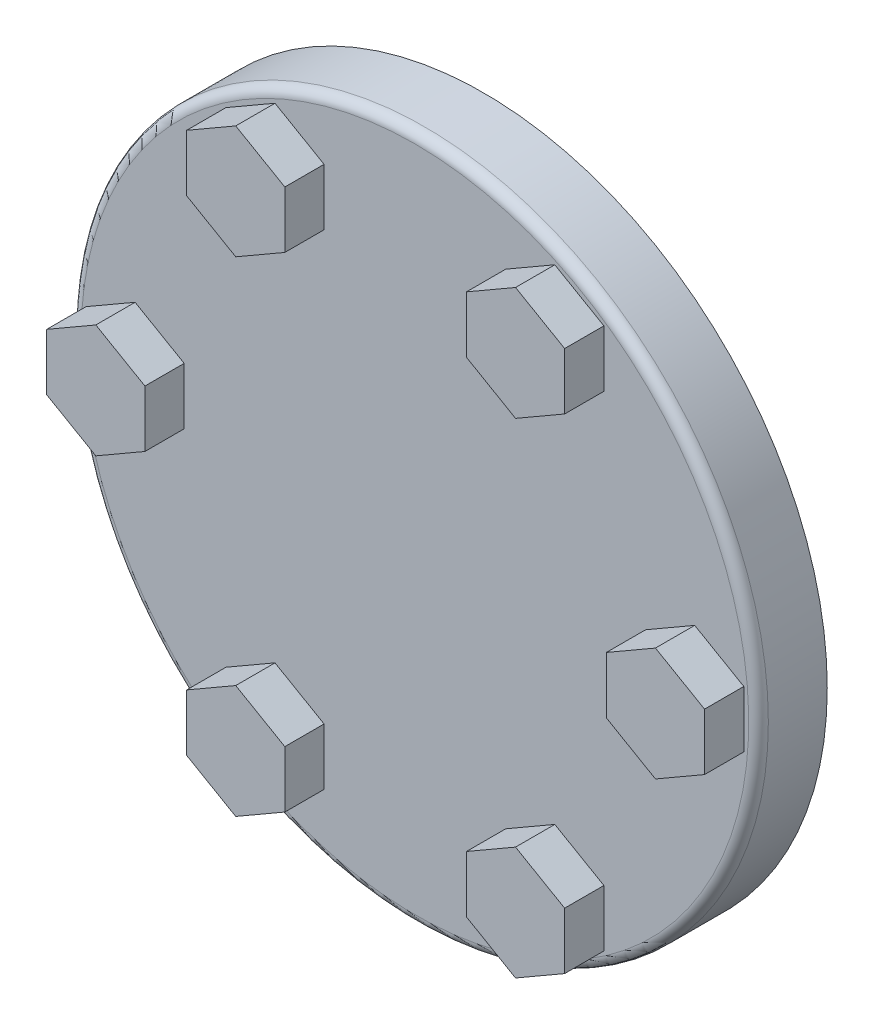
ISO-10303-21;
HEADER;
FILE_DESCRIPTION(('STEP AP214'),'2;1');
FILE_NAME('part.step','',(''),(''),'','','');
FILE_SCHEMA(('AUTOMOTIVE_DESIGN { 1 0 10303 214 1 1 1 1 }'));
ENDSEC;
DATA;
#1=APPLICATION_CONTEXT('core data for automotive mechanical design processes');
#2=APPLICATION_PROTOCOL_DEFINITION('international standard','automotive_design',2000,#1);
#3=PRODUCT_CONTEXT('',#1,'mechanical');
#4=PRODUCT('Part','Part','',(#3));
#5=PRODUCT_RELATED_PRODUCT_CATEGORY('part','',(#4));
#6=PRODUCT_DEFINITION_FORMATION('','',#4);
#7=PRODUCT_DEFINITION_CONTEXT('part definition',#1,'design');
#8=PRODUCT_DEFINITION('design','',#6,#7);
#9=PRODUCT_DEFINITION_SHAPE('','',#8);
#10=(LENGTH_UNIT() NAMED_UNIT(*) SI_UNIT(.MILLI.,.METRE.));
#11=(NAMED_UNIT(*) PLANE_ANGLE_UNIT() SI_UNIT($,.RADIAN.));
#12=(NAMED_UNIT(*) SI_UNIT($,.STERADIAN.) SOLID_ANGLE_UNIT());
#13=UNCERTAINTY_MEASURE_WITH_UNIT(LENGTH_MEASURE(1.E-05),#10,'distance_accuracy_value','');
#14=(GEOMETRIC_REPRESENTATION_CONTEXT(3) GLOBAL_UNCERTAINTY_ASSIGNED_CONTEXT((#13)) GLOBAL_UNIT_ASSIGNED_CONTEXT((#10,
#11,#12)) REPRESENTATION_CONTEXT('',''));
#15=CARTESIAN_POINT('',(0.,0.,0.));
#16=DIRECTION('',(0.,0.,1.));
#17=DIRECTION('',(1.,0.,0.));
#18=AXIS2_PLACEMENT_3D('',#15,#16,#17);
#19=CARTESIAN_POINT('',(16.7499999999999,17.464845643,178.5));
#20=DIRECTION('',(0.,0.,-1.));
#21=DIRECTION('',(-1.,0.,0.));
#22=AXIS2_PLACEMENT_3D('',#19,#20,#21);
#23=PLANE('',#22);
#24=DIRECTION('',(0.,1.,0.));
#25=VECTOR('',#24,1.);
#26=CARTESIAN_POINT('',(9.24999999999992,21.794972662,178.5));
#27=LINE('',#26,#25);
#28=CARTESIAN_POINT('',(9.24999999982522,27.5684753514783,178.5));
#29=VERTEX_POINT('',#28);
#30=CARTESIAN_POINT('',(9.25000000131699,21.7949726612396,178.5));
#31=VERTEX_POINT('',#30);
#32=EDGE_CURVE('E267',#29,#31,#27,.F.);
#33=ORIENTED_EDGE('',*,*,#32,.T.);
#34=DIRECTION('',(-0.866025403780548,0.500000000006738,0.));
#35=VECTOR('',#34,1.);
#36=CARTESIAN_POINT('',(14.2499999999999,18.908221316,178.5));
#37=LINE('',#36,#35);
#38=CARTESIAN_POINT('',(14.2499999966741,18.9082213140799,178.5));
#39=VERTEX_POINT('',#38);
#40=EDGE_CURVE('E257',#31,#39,#37,.F.);
#41=ORIENTED_EDGE('',*,*,#40,.T.);
#42=DIRECTION('',(-0.866025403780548,-0.500000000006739,0.));
#43=VECTOR('',#42,1.);
#44=CARTESIAN_POINT('',(19.2499999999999,21.794972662,178.5));
#45=LINE('',#44,#43);
#46=CARTESIAN_POINT('',(19.2500000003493,21.7949726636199,178.5));
#47=VERTEX_POINT('',#46);
#48=EDGE_CURVE('E310',#39,#47,#45,.F.);
#49=ORIENTED_EDGE('',*,*,#48,.T.);
#50=DIRECTION('',(0.,1.,0.));
#51=VECTOR('',#50,1.);
#52=CARTESIAN_POINT('',(19.2499999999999,27.568475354,178.5));
#53=LINE('',#52,#51);
#54=CARTESIAN_POINT('',(19.2500000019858,27.5684753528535,178.5));
#55=VERTEX_POINT('',#54);
#56=EDGE_CURVE('E295',#47,#55,#53,.T.);
#57=ORIENTED_EDGE('',*,*,#56,.T.);
#58=DIRECTION('',(0.866025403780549,-0.500000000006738,0.));
#59=VECTOR('',#58,1.);
#60=CARTESIAN_POINT('',(14.2499999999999,30.4552267,178.5));
#61=LINE('',#60,#59);
#62=CARTESIAN_POINT('',(14.249999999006,30.4552266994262,178.5));
#63=VERTEX_POINT('',#62);
#64=EDGE_CURVE('E288',#55,#63,#61,.F.);
#65=ORIENTED_EDGE('',*,*,#64,.T.);
#66=DIRECTION('',(0.866025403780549,0.500000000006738,0.));
#67=VECTOR('',#66,1.);
#68=CARTESIAN_POINT('',(9.24999999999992,27.568475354,178.5));
#69=LINE('',#68,#67);
#70=EDGE_CURVE('E275',#63,#29,#69,.F.);
#71=ORIENTED_EDGE('',*,*,#70,.T.);
#72=EDGE_LOOP('',(#33,#41,#49,#57,#65,#71));
#73=FACE_BOUND('',#72,.T.);
#74=ADVANCED_FACE('F16',(#73),#23,.F.);
#75=CARTESIAN_POINT('',(-23.5000000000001,5.773502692,178.5));
#76=DIRECTION('',(0.,0.,-1.));
#77=DIRECTION('',(-1.,0.,0.));
#78=AXIS2_PLACEMENT_3D('',#75,#76,#77);
#79=PLANE('',#78);
#80=DIRECTION('',(-0.866025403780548,-0.500000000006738,0.));
#81=VECTOR('',#80,1.);
#82=CARTESIAN_POINT('',(-23.5000000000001,-2.886751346,178.5));
#83=LINE('',#82,#81);
#84=CARTESIAN_POINT('',(-28.5000000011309,-5.77350269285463,178.5));
#85=VERTEX_POINT('',#84);
#86=CARTESIAN_POINT('',(-23.5000000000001,-2.88675134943,178.5));
#87=VERTEX_POINT('',#86);
#88=EDGE_CURVE('E317',#85,#87,#83,.F.);
#89=ORIENTED_EDGE('',*,*,#88,.T.);
#90=DIRECTION('',(0.,1.,0.));
#91=VECTOR('',#90,1.);
#92=CARTESIAN_POINT('',(-23.5000000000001,2.886751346,178.5));
#93=LINE('',#92,#91);
#94=CARTESIAN_POINT('',(-23.5000000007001,2.88675134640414,178.5));
#95=VERTEX_POINT('',#94);
#96=EDGE_CURVE('E309',#87,#95,#93,.T.);
#97=ORIENTED_EDGE('',*,*,#96,.T.);
#98=DIRECTION('',(0.866025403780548,-0.500000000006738,0.));
#99=VECTOR('',#98,1.);
#100=CARTESIAN_POINT('',(-28.5000000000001,5.773502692,178.5));
#101=LINE('',#100,#99);
#102=CARTESIAN_POINT('',(-28.5000000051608,5.77350268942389,178.5));
#103=VERTEX_POINT('',#102);
#104=EDGE_CURVE('E355',#95,#103,#101,.F.);
#105=ORIENTED_EDGE('',*,*,#104,.T.);
#106=DIRECTION('',(0.866025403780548,0.500000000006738,0.));
#107=VECTOR('',#106,1.);
#108=CARTESIAN_POINT('',(-33.5000000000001,2.886751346,178.5));
#109=LINE('',#108,#107);
#110=CARTESIAN_POINT('',(-33.5000000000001,2.88675134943,178.5));
#111=VERTEX_POINT('',#110);
#112=EDGE_CURVE('E338',#103,#111,#109,.F.);
#113=ORIENTED_EDGE('',*,*,#112,.T.);
#114=DIRECTION('',(0.,1.,0.));
#115=VECTOR('',#114,1.);
#116=CARTESIAN_POINT('',(-33.5000000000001,-2.886751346,178.5));
#117=LINE('',#116,#115);
#118=CARTESIAN_POINT('',(-33.4999999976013,-2.88675134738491,178.5));
#119=VERTEX_POINT('',#118);
#120=EDGE_CURVE('E330',#111,#119,#117,.F.);
#121=ORIENTED_EDGE('',*,*,#120,.T.);
#122=DIRECTION('',(-0.866025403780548,0.500000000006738,0.));
#123=VECTOR('',#122,1.);
#124=CARTESIAN_POINT('',(-28.5000000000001,-5.773502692,178.5));
#125=LINE('',#124,#123);
#126=EDGE_CURVE('E322',#119,#85,#125,.F.);
#127=ORIENTED_EDGE('',*,*,#126,.T.);
#128=EDGE_LOOP('',(#89,#97,#105,#113,#121,#127));
#129=FACE_BOUND('',#128,.T.);
#130=ADVANCED_FACE('F1011',(#129),#79,.F.);
#131=CARTESIAN_POINT('',(6.74999999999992,-23.238348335,178.5));
#132=DIRECTION('',(0.,0.,-1.));
#133=DIRECTION('',(-1.,0.,0.));
#134=AXIS2_PLACEMENT_3D('',#131,#132,#133);
#135=PLANE('',#134);
#136=DIRECTION('',(0.866025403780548,-0.500000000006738,0.));
#137=VECTOR('',#136,1.);
#138=CARTESIAN_POINT('',(14.2499999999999,-18.908221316,178.5));
#139=LINE('',#138,#137);
#140=CARTESIAN_POINT('',(19.2500000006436,-21.7949726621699,178.5));
#141=VERTEX_POINT('',#140);
#142=CARTESIAN_POINT('',(14.2500000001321,-18.9082213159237,178.5));
#143=VERTEX_POINT('',#142);
#144=EDGE_CURVE('E363',#141,#143,#139,.F.);
#145=ORIENTED_EDGE('',*,*,#144,.T.);
#146=DIRECTION('',(0.866025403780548,0.500000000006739,0.));
#147=VECTOR('',#146,1.);
#148=CARTESIAN_POINT('',(9.24999999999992,-21.794972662,178.5));
#149=LINE('',#148,#147);
#150=CARTESIAN_POINT('',(9.25000000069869,-21.7949726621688,178.5));
#151=VERTEX_POINT('',#150);
#152=EDGE_CURVE('E354',#143,#151,#149,.F.);
#153=ORIENTED_EDGE('',*,*,#152,.T.);
#154=DIRECTION('',(0.,1.,0.));
#155=VECTOR('',#154,1.);
#156=CARTESIAN_POINT('',(9.24999999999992,-27.568475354,178.5));
#157=LINE('',#156,#155);
#158=CARTESIAN_POINT('',(9.25000000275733,-27.5684753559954,178.5));
#159=VERTEX_POINT('',#158);
#160=EDGE_CURVE('E401',#151,#159,#157,.F.);
#161=ORIENTED_EDGE('',*,*,#160,.T.);
#162=DIRECTION('',(-0.866025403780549,0.500000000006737,0.));
#163=VECTOR('',#162,1.);
#164=CARTESIAN_POINT('',(14.2499999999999,-30.4552267,178.5));
#165=LINE('',#164,#163);
#166=CARTESIAN_POINT('',(14.2499999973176,-30.4552267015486,178.5));
#167=VERTEX_POINT('',#166);
#168=EDGE_CURVE('E384',#159,#167,#165,.F.);
#169=ORIENTED_EDGE('',*,*,#168,.T.);
#170=DIRECTION('',(-0.866025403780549,-0.500000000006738,0.));
#171=VECTOR('',#170,1.);
#172=CARTESIAN_POINT('',(19.2499999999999,-27.568475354,178.5));
#173=LINE('',#172,#171);
#174=CARTESIAN_POINT('',(19.2499999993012,-27.5684753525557,178.5));
#175=VERTEX_POINT('',#174);
#176=EDGE_CURVE('E376',#167,#175,#173,.F.);
#177=ORIENTED_EDGE('',*,*,#176,.T.);
#178=DIRECTION('',(0.,1.,0.));
#179=VECTOR('',#178,1.);
#180=CARTESIAN_POINT('',(19.2499999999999,-21.794972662,178.5));
#181=LINE('',#180,#179);
#182=EDGE_CURVE('E368',#175,#141,#181,.T.);
#183=ORIENTED_EDGE('',*,*,#182,.T.);
#184=EDGE_LOOP('',(#145,#153,#161,#169,#177,#183));
#185=FACE_BOUND('',#184,.T.);
#186=ADVANCED_FACE('F1002',(#185),#135,.F.);
#187=CARTESIAN_POINT('',(23.4999999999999,-5.77350269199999,178.5));
#188=DIRECTION('',(0.,0.,-1.));
#189=DIRECTION('',(-1.,0.,0.));
#190=AXIS2_PLACEMENT_3D('',#187,#188,#189);
#191=PLANE('',#190);
#192=DIRECTION('',(0.866025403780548,0.500000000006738,0.));
#193=VECTOR('',#192,1.);
#194=CARTESIAN_POINT('',(23.4999999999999,2.88675134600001,178.5));
#195=LINE('',#194,#193);
#196=CARTESIAN_POINT('',(28.5000000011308,5.77350269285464,178.5));
#197=VERTEX_POINT('',#196);
#198=CARTESIAN_POINT('',(23.4999999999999,2.88675134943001,178.5));
#199=VERTEX_POINT('',#198);
#200=EDGE_CURVE('E410',#197,#199,#195,.F.);
#201=ORIENTED_EDGE('',*,*,#200,.T.);
#202=DIRECTION('',(0.,1.,0.));
#203=VECTOR('',#202,1.);
#204=CARTESIAN_POINT('',(23.4999999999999,2.88675134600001,178.5));
#205=LINE('',#204,#203);
#206=CARTESIAN_POINT('',(23.5000000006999,-2.88675134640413,178.5));
#207=VERTEX_POINT('',#206);
#208=EDGE_CURVE('E400',#199,#207,#205,.F.);
#209=ORIENTED_EDGE('',*,*,#208,.T.);
#210=DIRECTION('',(-0.866025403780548,0.500000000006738,0.));
#211=VECTOR('',#210,1.);
#212=CARTESIAN_POINT('',(28.4999999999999,-5.77350269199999,178.5));
#213=LINE('',#212,#211);
#214=CARTESIAN_POINT('',(28.5000000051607,-5.77350268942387,178.5));
#215=VERTEX_POINT('',#214);
#216=EDGE_CURVE('E448',#207,#215,#213,.F.);
#217=ORIENTED_EDGE('',*,*,#216,.T.);
#218=DIRECTION('',(-0.866025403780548,-0.500000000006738,0.));
#219=VECTOR('',#218,1.);
#220=CARTESIAN_POINT('',(33.4999999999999,-2.88675134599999,178.5));
#221=LINE('',#220,#219);
#222=CARTESIAN_POINT('',(33.4999999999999,-2.88675134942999,178.5));
#223=VERTEX_POINT('',#222);
#224=EDGE_CURVE('E431',#215,#223,#221,.F.);
#225=ORIENTED_EDGE('',*,*,#224,.T.);
#226=DIRECTION('',(0.,1.,0.));
#227=VECTOR('',#226,1.);
#228=CARTESIAN_POINT('',(33.4999999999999,2.88675134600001,178.5));
#229=LINE('',#228,#227);
#230=CARTESIAN_POINT('',(33.4999999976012,2.88675134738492,178.5));
#231=VERTEX_POINT('',#230);
#232=EDGE_CURVE('E423',#223,#231,#229,.T.);
#233=ORIENTED_EDGE('',*,*,#232,.T.);
#234=DIRECTION('',(0.866025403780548,-0.500000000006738,0.));
#235=VECTOR('',#234,1.);
#236=CARTESIAN_POINT('',(28.4999999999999,5.77350269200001,178.5));
#237=LINE('',#236,#235);
#238=EDGE_CURVE('E415',#231,#197,#237,.F.);
#239=ORIENTED_EDGE('',*,*,#238,.T.);
#240=EDGE_LOOP('',(#201,#209,#217,#225,#233,#239));
#241=FACE_BOUND('',#240,.T.);
#242=ADVANCED_FACE('F993',(#241),#191,.F.);
#243=CARTESIAN_POINT('',(-16.7500000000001,-17.464845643,178.5));
#244=DIRECTION('',(0.,0.,-1.));
#245=DIRECTION('',(-1.,0.,0.));
#246=AXIS2_PLACEMENT_3D('',#243,#244,#245);
#247=PLANE('',#246);
#248=DIRECTION('',(0.,1.,0.));
#249=VECTOR('',#248,1.);
#250=CARTESIAN_POINT('',(-9.25000000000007,-21.794972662,178.5));
#251=LINE('',#250,#249);
#252=CARTESIAN_POINT('',(-9.24999999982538,-27.5684753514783,178.5));
#253=VERTEX_POINT('',#252);
#254=CARTESIAN_POINT('',(-9.25000000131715,-21.7949726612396,178.5));
#255=VERTEX_POINT('',#254);
#256=EDGE_CURVE('E457',#253,#255,#251,.T.);
#257=ORIENTED_EDGE('',*,*,#256,.T.);
#258=DIRECTION('',(0.866025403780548,-0.500000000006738,0.));
#259=VECTOR('',#258,1.);
#260=CARTESIAN_POINT('',(-14.2500000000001,-18.908221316,178.5));
#261=LINE('',#260,#259);
#262=CARTESIAN_POINT('',(-14.2499999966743,-18.9082213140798,178.5));
#263=VERTEX_POINT('',#262);
#264=EDGE_CURVE('E447',#255,#263,#261,.F.);
#265=ORIENTED_EDGE('',*,*,#264,.T.);
#266=DIRECTION('',(0.866025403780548,0.500000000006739,0.));
#267=VECTOR('',#266,1.);
#268=CARTESIAN_POINT('',(-19.2500000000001,-21.794972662,178.5));
#269=LINE('',#268,#267);
#270=CARTESIAN_POINT('',(-19.2500000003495,-21.7949726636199,178.5));
#271=VERTEX_POINT('',#270);
#272=EDGE_CURVE('E495',#263,#271,#269,.F.);
#273=ORIENTED_EDGE('',*,*,#272,.T.);
#274=DIRECTION('',(0.,1.,0.));
#275=VECTOR('',#274,1.);
#276=CARTESIAN_POINT('',(-19.2500000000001,-27.568475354,178.5));
#277=LINE('',#276,#275);
#278=CARTESIAN_POINT('',(-19.250000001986,-27.5684753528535,178.5));
#279=VERTEX_POINT('',#278);
#280=EDGE_CURVE('E478',#271,#279,#277,.F.);
#281=ORIENTED_EDGE('',*,*,#280,.T.);
#282=DIRECTION('',(-0.866025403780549,0.500000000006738,0.));
#283=VECTOR('',#282,1.);
#284=CARTESIAN_POINT('',(-14.2500000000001,-30.4552267,178.5));
#285=LINE('',#284,#283);
#286=CARTESIAN_POINT('',(-14.2499999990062,-30.4552266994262,178.5));
#287=VERTEX_POINT('',#286);
#288=EDGE_CURVE('E470',#279,#287,#285,.F.);
#289=ORIENTED_EDGE('',*,*,#288,.T.);
#290=DIRECTION('',(-0.866025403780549,-0.500000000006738,0.));
#291=VECTOR('',#290,1.);
#292=CARTESIAN_POINT('',(-9.25000000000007,-27.568475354,178.5));
#293=LINE('',#292,#291);
#294=EDGE_CURVE('E462',#287,#253,#293,.F.);
#295=ORIENTED_EDGE('',*,*,#294,.T.);
#296=EDGE_LOOP('',(#257,#265,#273,#281,#289,#295));
#297=FACE_BOUND('',#296,.T.);
#298=ADVANCED_FACE('F984',(#297),#247,.F.);
#299=CARTESIAN_POINT('',(-6.75000000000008,23.238348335,178.5));
#300=DIRECTION('',(0.,0.,-1.));
#301=DIRECTION('',(-1.,0.,0.));
#302=AXIS2_PLACEMENT_3D('',#299,#300,#301);
#303=PLANE('',#302);
#304=DIRECTION('',(-0.866025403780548,0.500000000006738,0.));
#305=VECTOR('',#304,1.);
#306=CARTESIAN_POINT('',(-14.2500000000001,18.908221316,178.5));
#307=LINE('',#306,#305);
#308=CARTESIAN_POINT('',(-19.2500000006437,21.7949726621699,178.5));
#309=VERTEX_POINT('',#308);
#310=CARTESIAN_POINT('',(-14.2500000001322,18.9082213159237,178.5));
#311=VERTEX_POINT('',#310);
#312=EDGE_CURVE('E504',#309,#311,#307,.F.);
#313=ORIENTED_EDGE('',*,*,#312,.T.);
#314=DIRECTION('',(-0.866025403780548,-0.500000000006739,0.));
#315=VECTOR('',#314,1.);
#316=CARTESIAN_POINT('',(-9.25000000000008,21.794972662,178.5));
#317=LINE('',#316,#315);
#318=CARTESIAN_POINT('',(-9.25000000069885,21.7949726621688,178.5));
#319=VERTEX_POINT('',#318);
#320=EDGE_CURVE('E494',#311,#319,#317,.F.);
#321=ORIENTED_EDGE('',*,*,#320,.T.);
#322=DIRECTION('',(0.,1.,0.));
#323=VECTOR('',#322,1.);
#324=CARTESIAN_POINT('',(-9.25000000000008,27.568475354,178.5));
#325=LINE('',#324,#323);
#326=CARTESIAN_POINT('',(-9.25000000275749,27.5684753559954,178.5));
#327=VERTEX_POINT('',#326);
#328=EDGE_CURVE('E538',#319,#327,#325,.T.);
#329=ORIENTED_EDGE('',*,*,#328,.T.);
#330=DIRECTION('',(0.866025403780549,-0.500000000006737,0.));
#331=VECTOR('',#330,1.);
#332=CARTESIAN_POINT('',(-14.2500000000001,30.4552267,178.5));
#333=LINE('',#332,#331);
#334=CARTESIAN_POINT('',(-14.2499999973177,30.4552267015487,178.5));
#335=VERTEX_POINT('',#334);
#336=EDGE_CURVE('E150',#327,#335,#333,.F.);
#337=ORIENTED_EDGE('',*,*,#336,.T.);
#338=DIRECTION('',(0.866025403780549,0.500000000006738,0.));
#339=VECTOR('',#338,1.);
#340=CARTESIAN_POINT('',(-19.2500000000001,27.568475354,178.5));
#341=LINE('',#340,#339);
#342=CARTESIAN_POINT('',(-19.2499999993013,27.5684753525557,178.5));
#343=VERTEX_POINT('',#342);
#344=EDGE_CURVE('E517',#335,#343,#341,.F.);
#345=ORIENTED_EDGE('',*,*,#344,.T.);
#346=DIRECTION('',(0.,1.,0.));
#347=VECTOR('',#346,1.);
#348=CARTESIAN_POINT('',(-19.2500000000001,21.794972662,178.5));
#349=LINE('',#348,#347);
#350=EDGE_CURVE('E509',#343,#309,#349,.F.);
#351=ORIENTED_EDGE('',*,*,#350,.T.);
#352=EDGE_LOOP('',(#313,#321,#329,#337,#345,#351));
#353=FACE_BOUND('',#352,.T.);
#354=ADVANCED_FACE('F976',(#353),#303,.F.);
#355=CARTESIAN_POINT('',(14.2499999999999,18.908221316,174.5));
#356=DIRECTION('',(0.500000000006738,0.866025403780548,0.));
#357=DIRECTION('',(-0.866025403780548,0.500000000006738,0.));
#358=AXIS2_PLACEMENT_3D('',#355,#356,#357);
#359=PLANE('',#358);
#360=ORIENTED_EDGE('',*,*,#40,.F.);
#361=DIRECTION('',(0.,0.,1.));
#362=VECTOR('',#361,1.);
#363=CARTESIAN_POINT('',(9.24999999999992,21.794972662,174.5));
#364=LINE('',#363,#362);
#365=CARTESIAN_POINT('',(9.25000000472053,21.7949726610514,174.5));
#366=VERTEX_POINT('',#365);
#367=EDGE_CURVE('E261',#31,#366,#364,.F.);
#368=ORIENTED_EDGE('',*,*,#367,.T.);
#369=DIRECTION('',(-0.866025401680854,0.500000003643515,0.));
#370=VECTOR('',#369,1.);
#371=CARTESIAN_POINT('',(14.2499999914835,18.9082213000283,174.5));
#372=LINE('',#371,#370);
#373=CARTESIAN_POINT('',(14.249999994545,18.9082213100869,174.5));
#374=VERTEX_POINT('',#373);
#375=EDGE_CURVE('E537',#374,#366,#372,.T.);
#376=ORIENTED_EDGE('',*,*,#375,.F.);
#377=DIRECTION('',(0.,0.,1.));
#378=VECTOR('',#377,1.);
#379=CARTESIAN_POINT('',(14.2499999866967,18.9082213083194,174.5));
#380=LINE('',#379,#378);
#381=EDGE_CURVE('E143',#374,#39,#380,.T.);
#382=ORIENTED_EDGE('',*,*,#381,.T.);
#383=EDGE_LOOP('',(#360,#368,#376,#382));
#384=FACE_BOUND('',#383,.T.);
#385=ADVANCED_FACE('F259',(#384),#359,.F.);
#386=CARTESIAN_POINT('',(9.24999999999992,21.794972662,174.5));
#387=DIRECTION('',(1.,0.,0.));
#388=DIRECTION('',(0.,1.,0.));
#389=AXIS2_PLACEMENT_3D('',#386,#387,#388);
#390=PLANE('',#389);
#391=ORIENTED_EDGE('',*,*,#32,.F.);
#392=DIRECTION('',(0.,0.,1.));
#393=VECTOR('',#392,1.);
#394=CARTESIAN_POINT('',(9.24999999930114,27.5684753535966,174.5));
#395=LINE('',#394,#393);
#396=CARTESIAN_POINT('',(9.25000000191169,27.5684753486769,174.5));
#397=VERTEX_POINT('',#396);
#398=EDGE_CURVE('E285',#29,#397,#395,.F.);
#399=ORIENTED_EDGE('',*,*,#398,.T.);
#400=DIRECTION('',(0.,-1.,0.));
#401=VECTOR('',#400,1.);
#402=CARTESIAN_POINT('',(9.25000000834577,34.408,174.5));
#403=LINE('',#402,#401);
#404=EDGE_CURVE('E273',#366,#397,#403,.F.);
#405=ORIENTED_EDGE('',*,*,#404,.F.);
#406=ORIENTED_EDGE('',*,*,#367,.F.);
#407=EDGE_LOOP('',(#391,#399,#405,#406));
#408=FACE_BOUND('',#407,.T.);
#409=ADVANCED_FACE('F270',(#408),#390,.F.);
#410=CARTESIAN_POINT('',(9.24999999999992,27.568475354,174.5));
#411=DIRECTION('',(0.500000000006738,-0.866025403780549,0.));
#412=DIRECTION('',(0.866025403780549,0.500000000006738,0.));
#413=AXIS2_PLACEMENT_3D('',#410,#411,#412);
#414=PLANE('',#413);
#415=ORIENTED_EDGE('',*,*,#70,.F.);
#416=DIRECTION('',(0.,0.,1.));
#417=VECTOR('',#416,1.);
#418=CARTESIAN_POINT('',(14.2499999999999,30.4552267,174.5));
#419=LINE('',#418,#417);
#420=CARTESIAN_POINT('',(14.2499999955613,30.455226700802,174.5));
#421=VERTEX_POINT('',#420);
#422=EDGE_CURVE('E291',#63,#421,#419,.F.);
#423=ORIENTED_EDGE('',*,*,#422,.T.);
#424=DIRECTION('',(0.866025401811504,0.500000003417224,0.));
#425=VECTOR('',#424,1.);
#426=CARTESIAN_POINT('',(9.25000001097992,27.568475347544,174.5));
#427=LINE('',#426,#425);
#428=EDGE_CURVE('E692',#397,#421,#427,.T.);
#429=ORIENTED_EDGE('',*,*,#428,.F.);
#430=ORIENTED_EDGE('',*,*,#398,.F.);
#431=EDGE_LOOP('',(#415,#423,#429,#430));
#432=FACE_BOUND('',#431,.T.);
#433=ADVANCED_FACE('F709',(#432),#414,.F.);
#434=CARTESIAN_POINT('',(14.2499999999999,30.4552267,174.5));
#435=DIRECTION('',(-0.500000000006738,-0.866025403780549,0.));
#436=DIRECTION('',(0.866025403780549,-0.500000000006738,0.));
#437=AXIS2_PLACEMENT_3D('',#434,#435,#436);
#438=PLANE('',#437);
#439=ORIENTED_EDGE('',*,*,#64,.F.);
#440=DIRECTION('',(0.,0.,1.));
#441=VECTOR('',#440,1.);
#442=CARTESIAN_POINT('',(19.2499999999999,27.568475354,174.5));
#443=LINE('',#442,#441);
#444=CARTESIAN_POINT('',(19.2500000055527,27.5684753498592,174.5));
#445=VERTEX_POINT('',#444);
#446=EDGE_CURVE('E298',#55,#445,#443,.F.);
#447=ORIENTED_EDGE('',*,*,#446,.T.);
#448=DIRECTION('',(0.866025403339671,-0.50000000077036,0.));
#449=VECTOR('',#448,1.);
#450=CARTESIAN_POINT('',(14.2499999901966,30.4552267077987,174.5));
#451=LINE('',#450,#449);
#452=EDGE_CURVE('E689',#421,#445,#451,.T.);
#453=ORIENTED_EDGE('',*,*,#452,.F.);
#454=ORIENTED_EDGE('',*,*,#422,.F.);
#455=EDGE_LOOP('',(#439,#447,#453,#454));
#456=FACE_BOUND('',#455,.T.);
#457=ADVANCED_FACE('F705',(#456),#438,.F.);
#458=CARTESIAN_POINT('',(19.2499999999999,27.568475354,174.5));
#459=DIRECTION('',(-1.,0.,0.));
#460=DIRECTION('',(0.,0.,1.));
#461=AXIS2_PLACEMENT_3D('',#458,#459,#460);
#462=PLANE('',#461);
#463=ORIENTED_EDGE('',*,*,#56,.F.);
#464=DIRECTION('',(0.,0.,1.));
#465=VECTOR('',#464,1.);
#466=CARTESIAN_POINT('',(19.2500000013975,21.7949726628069,174.5));
#467=LINE('',#466,#465);
#468=CARTESIAN_POINT('',(19.2500000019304,21.7949726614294,174.5));
#469=VERTEX_POINT('',#468);
#470=EDGE_CURVE('E305',#47,#469,#467,.F.);
#471=ORIENTED_EDGE('',*,*,#470,.T.);
#472=DIRECTION('',(0.,-1.,0.));
#473=VECTOR('',#472,1.);
#474=CARTESIAN_POINT('',(19.2500000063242,34.408,174.5));
#475=LINE('',#474,#473);
#476=EDGE_CURVE('E686',#445,#469,#475,.T.);
#477=ORIENTED_EDGE('',*,*,#476,.F.);
#478=ORIENTED_EDGE('',*,*,#446,.F.);
#479=EDGE_LOOP('',(#463,#471,#477,#478));
#480=FACE_BOUND('',#479,.T.);
#481=ADVANCED_FACE('F702',(#480),#462,.F.);
#482=CARTESIAN_POINT('',(19.2499999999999,21.794972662,174.5));
#483=DIRECTION('',(-0.500000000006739,0.866025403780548,0.));
#484=DIRECTION('',(-0.866025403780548,-0.500000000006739,0.));
#485=AXIS2_PLACEMENT_3D('',#482,#483,#484);
#486=PLANE('',#485);
#487=ORIENTED_EDGE('',*,*,#48,.F.);
#488=ORIENTED_EDGE('',*,*,#381,.F.);
#489=DIRECTION('',(-0.866025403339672,-0.500000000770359,0.));
#490=VECTOR('',#489,1.);
#491=CARTESIAN_POINT('',(19.2500000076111,21.7949726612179,174.5));
#492=LINE('',#491,#490);
#493=EDGE_CURVE('E683',#469,#374,#492,.T.);
#494=ORIENTED_EDGE('',*,*,#493,.F.);
#495=ORIENTED_EDGE('',*,*,#470,.F.);
#496=EDGE_LOOP('',(#487,#488,#494,#495));
#497=FACE_BOUND('',#496,.T.);
#498=ADVANCED_FACE('F699',(#497),#486,.F.);
#499=CARTESIAN_POINT('',(-23.5000000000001,2.886751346,174.5));
#500=DIRECTION('',(-1.,0.,0.));
#501=DIRECTION('',(0.,0.,1.));
#502=AXIS2_PLACEMENT_3D('',#499,#500,#501);
#503=PLANE('',#502);
#504=ORIENTED_EDGE('',*,*,#96,.F.);
#505=DIRECTION('',(0.,0.,1.));
#506=VECTOR('',#505,1.);
#507=CARTESIAN_POINT('',(-23.5000000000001,-2.886751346,174.5));
#508=LINE('',#507,#506);
#509=CARTESIAN_POINT('',(-23.4999999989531,-2.88675135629,174.5));
#510=VERTEX_POINT('',#509);
#511=EDGE_CURVE('E318',#87,#510,#508,.F.);
#512=ORIENTED_EDGE('',*,*,#511,.T.);
#513=DIRECTION('',(0.,-1.,0.));
#514=VECTOR('',#513,1.);
#515=CARTESIAN_POINT('',(-23.4999999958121,34.408,174.5));
#516=LINE('',#515,#514);
#517=CARTESIAN_POINT('',(-23.4999999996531,2.88675134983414,174.5));
#518=VERTEX_POINT('',#517);
#519=EDGE_CURVE('E680',#518,#510,#516,.T.);
#520=ORIENTED_EDGE('',*,*,#519,.F.);
#521=DIRECTION('',(0.,0.,1.));
#522=VECTOR('',#521,1.);
#523=CARTESIAN_POINT('',(-23.5000000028,2.88675134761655,174.5));
#524=LINE('',#523,#522);
#525=EDGE_CURVE('E346',#518,#95,#524,.T.);
#526=ORIENTED_EDGE('',*,*,#525,.T.);
#527=EDGE_LOOP('',(#504,#512,#520,#526));
#528=FACE_BOUND('',#527,.T.);
#529=ADVANCED_FACE('F934',(#528),#503,.F.);
#530=CARTESIAN_POINT('',(-23.5000000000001,-2.886751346,174.5));
#531=DIRECTION('',(-0.500000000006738,0.866025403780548,0.));
#532=DIRECTION('',(-0.866025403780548,-0.500000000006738,0.));
#533=AXIS2_PLACEMENT_3D('',#530,#531,#532);
#534=PLANE('',#533);
#535=ORIENTED_EDGE('',*,*,#88,.F.);
#536=DIRECTION('',(0.,0.,1.));
#537=VECTOR('',#536,1.);
#538=CARTESIAN_POINT('',(-28.4999999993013,-5.77350269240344,174.5));
#539=LINE('',#538,#537);
#540=CARTESIAN_POINT('',(-28.5000000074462,-5.77350269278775,174.5));
#541=VERTEX_POINT('',#540);
#542=EDGE_CURVE('E326',#85,#541,#539,.F.);
#543=ORIENTED_EDGE('',*,*,#542,.T.);
#544=DIRECTION('',(-0.866025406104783,-0.499999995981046,0.));
#545=VECTOR('',#544,1.);
#546=CARTESIAN_POINT('',(-23.4999999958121,-2.88675135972,174.5));
#547=LINE('',#546,#545);
#548=EDGE_CURVE('E677',#510,#541,#547,.T.);
#549=ORIENTED_EDGE('',*,*,#548,.F.);
#550=ORIENTED_EDGE('',*,*,#511,.F.);
#551=EDGE_LOOP('',(#535,#543,#549,#550));
#552=FACE_BOUND('',#551,.T.);
#553=ADVANCED_FACE('F927',(#552),#534,.F.);
#554=CARTESIAN_POINT('',(-28.5000000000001,-5.773502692,174.5));
#555=DIRECTION('',(0.500000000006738,0.866025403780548,0.));
#556=DIRECTION('',(-0.866025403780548,0.500000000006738,0.));
#557=AXIS2_PLACEMENT_3D('',#554,#555,#556);
#558=PLANE('',#557);
#559=ORIENTED_EDGE('',*,*,#126,.F.);
#560=DIRECTION('',(0.,0.,1.));
#561=VECTOR('',#560,1.);
#562=CARTESIAN_POINT('',(-33.5000000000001,-2.886751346,174.5));
#563=LINE('',#562,#561);
#564=CARTESIAN_POINT('',(-33.4999999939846,-2.88675135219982,174.5));
#565=VERTEX_POINT('',#564);
#566=EDGE_CURVE('E334',#119,#565,#563,.F.);
#567=ORIENTED_EDGE('',*,*,#566,.T.);
#568=DIRECTION('',(-0.866025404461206,0.499999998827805,0.));
#569=VECTOR('',#568,1.);
#570=CARTESIAN_POINT('',(-28.5000000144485,-5.77350268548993,174.5));
#571=LINE('',#570,#569);
#572=EDGE_CURVE('E674',#541,#565,#571,.T.);
#573=ORIENTED_EDGE('',*,*,#572,.F.);
#574=ORIENTED_EDGE('',*,*,#542,.F.);
#575=EDGE_LOOP('',(#559,#567,#573,#574));
#576=FACE_BOUND('',#575,.T.);
#577=ADVANCED_FACE('F920',(#576),#558,.F.);
#578=CARTESIAN_POINT('',(-33.5000000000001,-2.886751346,174.5));
#579=DIRECTION('',(1.,0.,0.));
#580=DIRECTION('',(0.,1.,0.));
#581=AXIS2_PLACEMENT_3D('',#578,#579,#580);
#582=PLANE('',#581);
#583=ORIENTED_EDGE('',*,*,#120,.F.);
#584=DIRECTION('',(0.,0.,1.));
#585=VECTOR('',#584,1.);
#586=CARTESIAN_POINT('',(-33.5000000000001,2.886751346,174.5));
#587=LINE('',#586,#585);
#588=CARTESIAN_POINT('',(-33.4999999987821,2.88675135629,174.5));
#589=VERTEX_POINT('',#588);
#590=EDGE_CURVE('E342',#111,#589,#587,.F.);
#591=ORIENTED_EDGE('',*,*,#590,.T.);
#592=DIRECTION('',(0.,-1.,0.));
#593=VECTOR('',#592,1.);
#594=CARTESIAN_POINT('',(-33.4999999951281,34.408,174.5));
#595=LINE('',#594,#593);
#596=EDGE_CURVE('E671',#565,#589,#595,.F.);
#597=ORIENTED_EDGE('',*,*,#596,.F.);
#598=ORIENTED_EDGE('',*,*,#566,.F.);
#599=EDGE_LOOP('',(#583,#591,#597,#598));
#600=FACE_BOUND('',#599,.T.);
#601=ADVANCED_FACE('F913',(#600),#582,.F.);
#602=CARTESIAN_POINT('',(-33.5000000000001,2.886751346,174.5));
#603=DIRECTION('',(0.500000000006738,-0.866025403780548,0.));
#604=DIRECTION('',(0.866025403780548,0.500000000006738,0.));
#605=AXIS2_PLACEMENT_3D('',#602,#603,#604);
#606=PLANE('',#605);
#607=ORIENTED_EDGE('',*,*,#112,.F.);
#608=DIRECTION('',(0.,0.,1.));
#609=VECTOR('',#608,1.);
#610=CARTESIAN_POINT('',(-28.5000000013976,5.77350269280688,174.5));
#611=LINE('',#610,#609);
#612=CARTESIAN_POINT('',(-28.5000000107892,5.77350268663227,174.5));
#613=VERTEX_POINT('',#612);
#614=EDGE_CURVE('E350',#103,#613,#611,.F.);
#615=ORIENTED_EDGE('',*,*,#614,.T.);
#616=DIRECTION('',(0.866025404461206,0.499999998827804,0.));
#617=VECTOR('',#616,1.);
#618=CARTESIAN_POINT('',(-33.4999999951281,2.88675135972,174.5));
#619=LINE('',#618,#617);
#620=EDGE_CURVE('E668',#589,#613,#619,.T.);
#621=ORIENTED_EDGE('',*,*,#620,.F.);
#622=ORIENTED_EDGE('',*,*,#590,.F.);
#623=EDGE_LOOP('',(#607,#615,#621,#622));
#624=FACE_BOUND('',#623,.T.);
#625=ADVANCED_FACE('F906',(#624),#606,.F.);
#626=CARTESIAN_POINT('',(-28.5000000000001,5.773502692,174.5));
#627=DIRECTION('',(-0.500000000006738,-0.866025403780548,0.));
#628=DIRECTION('',(0.866025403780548,-0.500000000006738,0.));
#629=AXIS2_PLACEMENT_3D('',#626,#627,#628);
#630=PLANE('',#629);
#631=ORIENTED_EDGE('',*,*,#104,.F.);
#632=ORIENTED_EDGE('',*,*,#525,.F.);
#633=DIRECTION('',(0.866025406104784,-0.499999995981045,0.));
#634=VECTOR('',#633,1.);
#635=CARTESIAN_POINT('',(-28.5000000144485,5.77350268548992,174.5));
#636=LINE('',#635,#634);
#637=EDGE_CURVE('E664',#613,#518,#636,.T.);
#638=ORIENTED_EDGE('',*,*,#637,.F.);
#639=ORIENTED_EDGE('',*,*,#614,.F.);
#640=EDGE_LOOP('',(#631,#632,#638,#639));
#641=FACE_BOUND('',#640,.T.);
#642=ADVANCED_FACE('F899',(#641),#630,.F.);
#643=CARTESIAN_POINT('',(9.24999999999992,-21.794972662,174.5));
#644=DIRECTION('',(0.500000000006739,-0.866025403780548,0.));
#645=DIRECTION('',(0.866025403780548,0.500000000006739,0.));
#646=AXIS2_PLACEMENT_3D('',#643,#644,#645);
#647=PLANE('',#646);
#648=ORIENTED_EDGE('',*,*,#152,.F.);
#649=DIRECTION('',(0.,0.,1.));
#650=VECTOR('',#649,1.);
#651=CARTESIAN_POINT('',(14.2499999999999,-18.908221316,174.5));
#652=LINE('',#651,#650);
#653=CARTESIAN_POINT('',(14.2499999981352,-18.9082213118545,174.5));
#654=VERTEX_POINT('',#653);
#655=EDGE_CURVE('E364',#143,#654,#652,.F.);
#656=ORIENTED_EDGE('',*,*,#655,.T.);
#657=DIRECTION('',(0.866025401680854,0.500000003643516,0.));
#658=VECTOR('',#657,1.);
#659=CARTESIAN_POINT('',(9.25000000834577,-21.7949726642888,174.5));
#660=LINE('',#659,#658);
#661=CARTESIAN_POINT('',(9.25000000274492,-21.7949726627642,174.5));
#662=VERTEX_POINT('',#661);
#663=EDGE_CURVE('E661',#662,#654,#660,.T.);
#664=ORIENTED_EDGE('',*,*,#663,.F.);
#665=DIRECTION('',(0.,0.,1.));
#666=VECTOR('',#665,1.);
#667=CARTESIAN_POINT('',(9.24999999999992,-21.7949726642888,174.5));
#668=LINE('',#667,#666);
#669=EDGE_CURVE('E392',#662,#151,#668,.T.);
#670=ORIENTED_EDGE('',*,*,#669,.T.);
#671=EDGE_LOOP('',(#648,#656,#664,#670));
#672=FACE_BOUND('',#671,.T.);
#673=ADVANCED_FACE('F892',(#672),#647,.F.);
#674=CARTESIAN_POINT('',(14.2499999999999,-18.908221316,174.5));
#675=DIRECTION('',(-0.500000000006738,-0.866025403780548,0.));
#676=DIRECTION('',(0.866025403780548,-0.500000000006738,0.));
#677=AXIS2_PLACEMENT_3D('',#674,#675,#676);
#678=PLANE('',#677);
#679=ORIENTED_EDGE('',*,*,#144,.F.);
#680=DIRECTION('',(0.,0.,1.));
#681=VECTOR('',#680,1.);
#682=CARTESIAN_POINT('',(19.2499999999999,-21.7949726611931,174.5));
#683=LINE('',#682,#681);
#684=CARTESIAN_POINT('',(19.2500000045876,-21.7949726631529,174.5));
#685=VERTEX_POINT('',#684);
#686=EDGE_CURVE('E372',#141,#685,#683,.F.);
#687=ORIENTED_EDGE('',*,*,#686,.T.);
#688=DIRECTION('',(0.866025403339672,-0.500000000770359,0.));
#689=VECTOR('',#688,1.);
#690=CARTESIAN_POINT('',(14.2499999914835,-18.9082213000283,174.5));
#691=LINE('',#690,#689);
#692=EDGE_CURVE('E659',#654,#685,#691,.T.);
#693=ORIENTED_EDGE('',*,*,#692,.F.);
#694=ORIENTED_EDGE('',*,*,#655,.F.);
#695=EDGE_LOOP('',(#679,#687,#693,#694));
#696=FACE_BOUND('',#695,.T.);
#697=ADVANCED_FACE('F885',(#696),#678,.F.);
#698=CARTESIAN_POINT('',(19.2499999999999,-21.794972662,174.5));
#699=DIRECTION('',(-1.,0.,0.));
#700=DIRECTION('',(0.,0.,1.));
#701=AXIS2_PLACEMENT_3D('',#698,#699,#700);
#702=PLANE('',#701);
#703=ORIENTED_EDGE('',*,*,#182,.F.);
#704=DIRECTION('',(0.,0.,1.));
#705=VECTOR('',#704,1.);
#706=CARTESIAN_POINT('',(19.2499999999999,-27.568475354,174.5));
#707=LINE('',#706,#705);
#708=CARTESIAN_POINT('',(19.2500000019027,-27.5684753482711,174.5));
#709=VERTEX_POINT('',#708);
#710=EDGE_CURVE('E380',#175,#709,#707,.F.);
#711=ORIENTED_EDGE('',*,*,#710,.T.);
#712=DIRECTION('',(0.,-1.,0.));
#713=VECTOR('',#712,1.);
#714=CARTESIAN_POINT('',(19.2500000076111,34.408,174.5));
#715=LINE('',#714,#713);
#716=EDGE_CURVE('E656',#685,#709,#715,.T.);
#717=ORIENTED_EDGE('',*,*,#716,.F.);
#718=ORIENTED_EDGE('',*,*,#686,.F.);
#719=EDGE_LOOP('',(#703,#711,#717,#718));
#720=FACE_BOUND('',#719,.T.);
#721=ADVANCED_FACE('F878',(#720),#702,.F.);
#722=CARTESIAN_POINT('',(19.2499999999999,-27.568475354,174.5));
#723=DIRECTION('',(-0.500000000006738,0.866025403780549,0.));
#724=DIRECTION('',(-0.866025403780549,-0.500000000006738,0.));
#725=AXIS2_PLACEMENT_3D('',#722,#723,#724);
#726=PLANE('',#725);
#727=ORIENTED_EDGE('',*,*,#176,.F.);
#728=DIRECTION('',(0.,0.,1.));
#729=VECTOR('',#728,1.);
#730=CARTESIAN_POINT('',(14.2499999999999,-30.4552267,174.5));
#731=LINE('',#730,#729);
#732=CARTESIAN_POINT('',(14.2499999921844,-30.455226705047,174.5));
#733=VERTEX_POINT('',#732);
#734=EDGE_CURVE('E388',#167,#733,#731,.F.);
#735=ORIENTED_EDGE('',*,*,#734,.T.);
#736=DIRECTION('',(-0.866025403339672,-0.500000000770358,0.));
#737=VECTOR('',#736,1.);
#738=CARTESIAN_POINT('',(19.2500000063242,-27.5684753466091,174.5));
#739=LINE('',#738,#737);
#740=EDGE_CURVE('E653',#709,#733,#739,.T.);
#741=ORIENTED_EDGE('',*,*,#740,.F.);
#742=ORIENTED_EDGE('',*,*,#710,.F.);
#743=EDGE_LOOP('',(#727,#735,#741,#742));
#744=FACE_BOUND('',#743,.T.);
#745=ADVANCED_FACE('F871',(#744),#726,.F.);
#746=CARTESIAN_POINT('',(14.2499999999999,-30.4552267,174.5));
#747=DIRECTION('',(0.500000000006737,0.866025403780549,0.));
#748=DIRECTION('',(-0.866025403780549,0.500000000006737,0.));
#749=AXIS2_PLACEMENT_3D('',#746,#747,#748);
#750=PLANE('',#749);
#751=ORIENTED_EDGE('',*,*,#168,.F.);
#752=DIRECTION('',(0.,0.,1.));
#753=VECTOR('',#752,1.);
#754=CARTESIAN_POINT('',(9.24999999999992,-27.5684753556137,174.5));
#755=LINE('',#754,#753);
#756=CARTESIAN_POINT('',(9.25000000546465,-27.5684753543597,174.5));
#757=VERTEX_POINT('',#756);
#758=EDGE_CURVE('E396',#159,#757,#755,.F.);
#759=ORIENTED_EDGE('',*,*,#758,.T.);
#760=DIRECTION('',(-0.866025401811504,0.500000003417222,0.));
#761=VECTOR('',#760,1.);
#762=CARTESIAN_POINT('',(14.2499999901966,-30.4552267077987,174.5));
#763=LINE('',#762,#761);
#764=EDGE_CURVE('E650',#733,#757,#763,.T.);
#765=ORIENTED_EDGE('',*,*,#764,.F.);
#766=ORIENTED_EDGE('',*,*,#734,.F.);
#767=EDGE_LOOP('',(#751,#759,#765,#766));
#768=FACE_BOUND('',#767,.T.);
#769=ADVANCED_FACE('F864',(#768),#750,.F.);
#770=CARTESIAN_POINT('',(9.24999999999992,-27.568475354,174.5));
#771=DIRECTION('',(1.,0.,0.));
#772=DIRECTION('',(0.,1.,0.));
#773=AXIS2_PLACEMENT_3D('',#770,#771,#772);
#774=PLANE('',#773);
#775=ORIENTED_EDGE('',*,*,#160,.F.);
#776=ORIENTED_EDGE('',*,*,#669,.F.);
#777=DIRECTION('',(0.,-1.,0.));
#778=VECTOR('',#777,1.);
#779=CARTESIAN_POINT('',(9.25000001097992,34.408,174.5));
#780=LINE('',#779,#778);
#781=EDGE_CURVE('E646',#757,#662,#780,.F.);
#782=ORIENTED_EDGE('',*,*,#781,.F.);
#783=ORIENTED_EDGE('',*,*,#758,.F.);
#784=EDGE_LOOP('',(#775,#776,#782,#783));
#785=FACE_BOUND('',#784,.T.);
#786=ADVANCED_FACE('F857',(#785),#774,.F.);
#787=CARTESIAN_POINT('',(23.4999999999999,2.88675134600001,174.5));
#788=DIRECTION('',(1.,0.,0.));
#789=DIRECTION('',(0.,1.,0.));
#790=AXIS2_PLACEMENT_3D('',#787,#788,#789);
#791=PLANE('',#790);
#792=ORIENTED_EDGE('',*,*,#208,.F.);
#793=DIRECTION('',(0.,0.,1.));
#794=VECTOR('',#793,1.);
#795=CARTESIAN_POINT('',(23.4999999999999,2.88675134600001,174.5));
#796=LINE('',#795,#794);
#797=CARTESIAN_POINT('',(23.4999999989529,2.88675135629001,174.5));
#798=VERTEX_POINT('',#797);
#799=EDGE_CURVE('E411',#199,#798,#796,.F.);
#800=ORIENTED_EDGE('',*,*,#799,.T.);
#801=DIRECTION('',(0.,-1.,0.));
#802=VECTOR('',#801,1.);
#803=CARTESIAN_POINT('',(23.4999999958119,34.408,174.5));
#804=LINE('',#803,#802);
#805=CARTESIAN_POINT('',(23.4999999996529,-2.88675134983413,174.5));
#806=VERTEX_POINT('',#805);
#807=EDGE_CURVE('E644',#806,#798,#804,.F.);
#808=ORIENTED_EDGE('',*,*,#807,.F.);
#809=DIRECTION('',(0.,0.,1.));
#810=VECTOR('',#809,1.);
#811=CARTESIAN_POINT('',(23.5000000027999,-2.88675134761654,174.5));
#812=LINE('',#811,#810);
#813=EDGE_CURVE('E439',#806,#207,#812,.T.);
#814=ORIENTED_EDGE('',*,*,#813,.T.);
#815=EDGE_LOOP('',(#792,#800,#808,#814));
#816=FACE_BOUND('',#815,.T.);
#817=ADVANCED_FACE('F850',(#816),#791,.F.);
#818=CARTESIAN_POINT('',(23.4999999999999,2.88675134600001,174.5));
#819=DIRECTION('',(0.500000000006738,-0.866025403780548,0.));
#820=DIRECTION('',(0.866025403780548,0.500000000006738,0.));
#821=AXIS2_PLACEMENT_3D('',#818,#819,#820);
#822=PLANE('',#821);
#823=ORIENTED_EDGE('',*,*,#200,.F.);
#824=DIRECTION('',(0.,0.,1.));
#825=VECTOR('',#824,1.);
#826=CARTESIAN_POINT('',(28.4999999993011,5.77350269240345,174.5));
#827=LINE('',#826,#825);
#828=CARTESIAN_POINT('',(28.500000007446,5.77350269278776,174.5));
#829=VERTEX_POINT('',#828);
#830=EDGE_CURVE('E419',#197,#829,#827,.F.);
#831=ORIENTED_EDGE('',*,*,#830,.T.);
#832=DIRECTION('',(0.866025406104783,0.499999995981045,0.));
#833=VECTOR('',#832,1.);
#834=CARTESIAN_POINT('',(23.4999999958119,2.88675135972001,174.5));
#835=LINE('',#834,#833);
#836=EDGE_CURVE('E641',#798,#829,#835,.T.);
#837=ORIENTED_EDGE('',*,*,#836,.F.);
#838=ORIENTED_EDGE('',*,*,#799,.F.);
#839=EDGE_LOOP('',(#823,#831,#837,#838));
#840=FACE_BOUND('',#839,.T.);
#841=ADVANCED_FACE('F843',(#840),#822,.F.);
#842=CARTESIAN_POINT('',(28.4999999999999,5.77350269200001,174.5));
#843=DIRECTION('',(-0.500000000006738,-0.866025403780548,0.));
#844=DIRECTION('',(0.866025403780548,-0.500000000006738,0.));
#845=AXIS2_PLACEMENT_3D('',#842,#843,#844);
#846=PLANE('',#845);
#847=ORIENTED_EDGE('',*,*,#238,.F.);
#848=DIRECTION('',(0.,0.,1.));
#849=VECTOR('',#848,1.);
#850=CARTESIAN_POINT('',(33.4999999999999,2.88675134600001,178.5));
#851=LINE('',#850,#849);
#852=CARTESIAN_POINT('',(33.4999999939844,2.88675135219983,174.5));
#853=VERTEX_POINT('',#852);
#854=EDGE_CURVE('E427',#231,#853,#851,.F.);
#855=ORIENTED_EDGE('',*,*,#854,.T.);
#856=DIRECTION('',(0.866025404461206,-0.499999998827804,0.));
#857=VECTOR('',#856,1.);
#858=CARTESIAN_POINT('',(28.5000000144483,5.77350268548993,174.5));
#859=LINE('',#858,#857);
#860=EDGE_CURVE('E638',#829,#853,#859,.T.);
#861=ORIENTED_EDGE('',*,*,#860,.F.);
#862=ORIENTED_EDGE('',*,*,#830,.F.);
#863=EDGE_LOOP('',(#847,#855,#861,#862));
#864=FACE_BOUND('',#863,.T.);
#865=ADVANCED_FACE('F836',(#864),#846,.F.);
#866=CARTESIAN_POINT('',(33.4999999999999,2.88675134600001,178.5));
#867=DIRECTION('',(-1.,0.,0.));
#868=DIRECTION('',(0.,0.,1.));
#869=AXIS2_PLACEMENT_3D('',#866,#867,#868);
#870=PLANE('',#869);
#871=ORIENTED_EDGE('',*,*,#232,.F.);
#872=DIRECTION('',(0.,0.,1.));
#873=VECTOR('',#872,1.);
#874=CARTESIAN_POINT('',(33.4999999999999,-2.88675134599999,174.5));
#875=LINE('',#874,#873);
#876=CARTESIAN_POINT('',(33.4999999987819,-2.88675135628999,174.5));
#877=VERTEX_POINT('',#876);
#878=EDGE_CURVE('E435',#223,#877,#875,.F.);
#879=ORIENTED_EDGE('',*,*,#878,.T.);
#880=DIRECTION('',(0.,-1.,0.));
#881=VECTOR('',#880,1.);
#882=CARTESIAN_POINT('',(33.4999999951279,34.408,174.5));
#883=LINE('',#882,#881);
#884=EDGE_CURVE('E635',#853,#877,#883,.T.);
#885=ORIENTED_EDGE('',*,*,#884,.F.);
#886=ORIENTED_EDGE('',*,*,#854,.F.);
#887=EDGE_LOOP('',(#871,#879,#885,#886));
#888=FACE_BOUND('',#887,.T.);
#889=ADVANCED_FACE('F829',(#888),#870,.F.);
#890=CARTESIAN_POINT('',(33.4999999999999,-2.88675134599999,174.5));
#891=DIRECTION('',(-0.500000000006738,0.866025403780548,0.));
#892=DIRECTION('',(-0.866025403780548,-0.500000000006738,0.));
#893=AXIS2_PLACEMENT_3D('',#890,#891,#892);
#894=PLANE('',#893);
#895=ORIENTED_EDGE('',*,*,#224,.F.);
#896=DIRECTION('',(0.,0.,1.));
#897=VECTOR('',#896,1.);
#898=CARTESIAN_POINT('',(28.5000000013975,-5.77350269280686,174.5));
#899=LINE('',#898,#897);
#900=CARTESIAN_POINT('',(28.500000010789,-5.77350268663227,174.5));
#901=VERTEX_POINT('',#900);
#902=EDGE_CURVE('E443',#215,#901,#899,.F.);
#903=ORIENTED_EDGE('',*,*,#902,.T.);
#904=DIRECTION('',(-0.866025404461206,-0.499999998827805,0.));
#905=VECTOR('',#904,1.);
#906=CARTESIAN_POINT('',(33.4999999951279,-2.88675135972,174.5));
#907=LINE('',#906,#905);
#908=EDGE_CURVE('E632',#877,#901,#907,.T.);
#909=ORIENTED_EDGE('',*,*,#908,.F.);
#910=ORIENTED_EDGE('',*,*,#878,.F.);
#911=EDGE_LOOP('',(#895,#903,#909,#910));
#912=FACE_BOUND('',#911,.T.);
#913=ADVANCED_FACE('F822',(#912),#894,.F.);
#914=CARTESIAN_POINT('',(28.4999999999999,-5.77350269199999,174.5));
#915=DIRECTION('',(0.500000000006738,0.866025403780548,0.));
#916=DIRECTION('',(-0.866025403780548,0.500000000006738,0.));
#917=AXIS2_PLACEMENT_3D('',#914,#915,#916);
#918=PLANE('',#917);
#919=ORIENTED_EDGE('',*,*,#216,.F.);
#920=ORIENTED_EDGE('',*,*,#813,.F.);
#921=DIRECTION('',(-0.866025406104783,0.499999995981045,0.));
#922=VECTOR('',#921,1.);
#923=CARTESIAN_POINT('',(28.5000000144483,-5.77350268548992,174.5));
#924=LINE('',#923,#922);
#925=EDGE_CURVE('E628',#901,#806,#924,.T.);
#926=ORIENTED_EDGE('',*,*,#925,.F.);
#927=ORIENTED_EDGE('',*,*,#902,.F.);
#928=EDGE_LOOP('',(#919,#920,#926,#927));
#929=FACE_BOUND('',#928,.T.);
#930=ADVANCED_FACE('F815',(#929),#918,.F.);
#931=CARTESIAN_POINT('',(-14.2500000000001,-18.908221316,174.5));
#932=DIRECTION('',(-0.500000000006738,-0.866025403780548,0.));
#933=DIRECTION('',(0.866025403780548,-0.500000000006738,0.));
#934=AXIS2_PLACEMENT_3D('',#931,#932,#933);
#935=PLANE('',#934);
#936=ORIENTED_EDGE('',*,*,#264,.F.);
#937=DIRECTION('',(0.,0.,1.));
#938=VECTOR('',#937,1.);
#939=CARTESIAN_POINT('',(-9.25000000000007,-21.794972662,174.5));
#940=LINE('',#939,#938);
#941=CARTESIAN_POINT('',(-9.25000000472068,-21.7949726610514,174.5));
#942=VERTEX_POINT('',#941);
#943=EDGE_CURVE('E458',#255,#942,#940,.F.);
#944=ORIENTED_EDGE('',*,*,#943,.T.);
#945=DIRECTION('',(0.866025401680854,-0.500000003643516,0.));
#946=VECTOR('',#945,1.);
#947=CARTESIAN_POINT('',(-14.2499999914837,-18.9082213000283,174.5));
#948=LINE('',#947,#946);
#949=CARTESIAN_POINT('',(-14.2499999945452,-18.9082213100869,174.5));
#950=VERTEX_POINT('',#949);
#951=EDGE_CURVE('E625',#950,#942,#948,.T.);
#952=ORIENTED_EDGE('',*,*,#951,.F.);
#953=DIRECTION('',(0.,0.,1.));
#954=VECTOR('',#953,1.);
#955=CARTESIAN_POINT('',(-14.2499999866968,-18.9082213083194,174.5));
#956=LINE('',#955,#954);
#957=EDGE_CURVE('E486',#950,#263,#956,.T.);
#958=ORIENTED_EDGE('',*,*,#957,.T.);
#959=EDGE_LOOP('',(#936,#944,#952,#958));
#960=FACE_BOUND('',#959,.T.);
#961=ADVANCED_FACE('F808',(#960),#935,.F.);
#962=CARTESIAN_POINT('',(-9.25000000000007,-21.794972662,174.5));
#963=DIRECTION('',(-1.,0.,0.));
#964=DIRECTION('',(0.,0.,1.));
#965=AXIS2_PLACEMENT_3D('',#962,#963,#964);
#966=PLANE('',#965);
#967=ORIENTED_EDGE('',*,*,#256,.F.);
#968=DIRECTION('',(0.,0.,1.));
#969=VECTOR('',#968,1.);
#970=CARTESIAN_POINT('',(-9.2499999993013,-27.5684753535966,174.5));
#971=LINE('',#970,#969);
#972=CARTESIAN_POINT('',(-9.25000000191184,-27.5684753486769,174.5));
#973=VERTEX_POINT('',#972);
#974=EDGE_CURVE('E466',#253,#973,#971,.F.);
#975=ORIENTED_EDGE('',*,*,#974,.T.);
#976=DIRECTION('',(0.,-1.,0.));
#977=VECTOR('',#976,1.);
#978=CARTESIAN_POINT('',(-9.25000000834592,34.408,174.5));
#979=LINE('',#978,#977);
#980=EDGE_CURVE('E622',#942,#973,#979,.T.);
#981=ORIENTED_EDGE('',*,*,#980,.F.);
#982=ORIENTED_EDGE('',*,*,#943,.F.);
#983=EDGE_LOOP('',(#967,#975,#981,#982));
#984=FACE_BOUND('',#983,.T.);
#985=ADVANCED_FACE('F801',(#984),#966,.F.);
#986=CARTESIAN_POINT('',(-9.25000000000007,-27.568475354,174.5));
#987=DIRECTION('',(-0.500000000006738,0.866025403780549,0.));
#988=DIRECTION('',(-0.866025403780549,-0.500000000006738,0.));
#989=AXIS2_PLACEMENT_3D('',#986,#987,#988);
#990=PLANE('',#989);
#991=ORIENTED_EDGE('',*,*,#294,.F.);
#992=DIRECTION('',(0.,0.,1.));
#993=VECTOR('',#992,1.);
#994=CARTESIAN_POINT('',(-14.2500000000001,-30.4552267,174.5));
#995=LINE('',#994,#993);
#996=CARTESIAN_POINT('',(-14.2499999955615,-30.455226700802,174.5));
#997=VERTEX_POINT('',#996);
#998=EDGE_CURVE('E474',#287,#997,#995,.F.);
#999=ORIENTED_EDGE('',*,*,#998,.T.);
#1000=DIRECTION('',(-0.866025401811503,-0.500000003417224,0.));
#1001=VECTOR('',#1000,1.);
#1002=CARTESIAN_POINT('',(-9.25000001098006,-27.568475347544,174.5));
#1003=LINE('',#1002,#1001);
#1004=EDGE_CURVE('E619',#973,#997,#1003,.T.);
#1005=ORIENTED_EDGE('',*,*,#1004,.F.);
#1006=ORIENTED_EDGE('',*,*,#974,.F.);
#1007=EDGE_LOOP('',(#991,#999,#1005,#1006));
#1008=FACE_BOUND('',#1007,.T.);
#1009=ADVANCED_FACE('F794',(#1008),#990,.F.);
#1010=CARTESIAN_POINT('',(-14.2500000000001,-30.4552267,174.5));
#1011=DIRECTION('',(0.500000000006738,0.866025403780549,0.));
#1012=DIRECTION('',(-0.866025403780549,0.500000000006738,0.));
#1013=AXIS2_PLACEMENT_3D('',#1010,#1011,#1012);
#1014=PLANE('',#1013);
#1015=ORIENTED_EDGE('',*,*,#288,.F.);
#1016=DIRECTION('',(0.,0.,1.));
#1017=VECTOR('',#1016,1.);
#1018=CARTESIAN_POINT('',(-19.2500000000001,-27.568475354,174.5));
#1019=LINE('',#1018,#1017);
#1020=CARTESIAN_POINT('',(-19.2500000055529,-27.5684753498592,174.5));
#1021=VERTEX_POINT('',#1020);
#1022=EDGE_CURVE('E482',#279,#1021,#1019,.F.);
#1023=ORIENTED_EDGE('',*,*,#1022,.T.);
#1024=DIRECTION('',(-0.866025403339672,0.500000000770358,0.));
#1025=VECTOR('',#1024,1.);
#1026=CARTESIAN_POINT('',(-14.2499999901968,-30.4552267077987,174.5));
#1027=LINE('',#1026,#1025);
#1028=EDGE_CURVE('E616',#997,#1021,#1027,.T.);
#1029=ORIENTED_EDGE('',*,*,#1028,.F.);
#1030=ORIENTED_EDGE('',*,*,#998,.F.);
#1031=EDGE_LOOP('',(#1015,#1023,#1029,#1030));
#1032=FACE_BOUND('',#1031,.T.);
#1033=ADVANCED_FACE('F787',(#1032),#1014,.F.);
#1034=CARTESIAN_POINT('',(-19.2500000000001,-27.568475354,174.5));
#1035=DIRECTION('',(1.,0.,0.));
#1036=DIRECTION('',(0.,1.,0.));
#1037=AXIS2_PLACEMENT_3D('',#1034,#1035,#1036);
#1038=PLANE('',#1037);
#1039=ORIENTED_EDGE('',*,*,#280,.F.);
#1040=DIRECTION('',(0.,0.,1.));
#1041=VECTOR('',#1040,1.);
#1042=CARTESIAN_POINT('',(-19.2500000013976,-21.7949726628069,174.5));
#1043=LINE('',#1042,#1041);
#1044=CARTESIAN_POINT('',(-19.2500000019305,-21.7949726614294,174.5));
#1045=VERTEX_POINT('',#1044);
#1046=EDGE_CURVE('E490',#271,#1045,#1043,.F.);
#1047=ORIENTED_EDGE('',*,*,#1046,.T.);
#1048=DIRECTION('',(0.,-1.,0.));
#1049=VECTOR('',#1048,1.);
#1050=CARTESIAN_POINT('',(-19.2500000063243,34.408,174.5));
#1051=LINE('',#1050,#1049);
#1052=EDGE_CURVE('E613',#1021,#1045,#1051,.F.);
#1053=ORIENTED_EDGE('',*,*,#1052,.F.);
#1054=ORIENTED_EDGE('',*,*,#1022,.F.);
#1055=EDGE_LOOP('',(#1039,#1047,#1053,#1054));
#1056=FACE_BOUND('',#1055,.T.);
#1057=ADVANCED_FACE('F780',(#1056),#1038,.F.);
#1058=CARTESIAN_POINT('',(-19.2500000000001,-21.794972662,174.5));
#1059=DIRECTION('',(0.500000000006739,-0.866025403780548,0.));
#1060=DIRECTION('',(0.866025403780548,0.500000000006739,0.));
#1061=AXIS2_PLACEMENT_3D('',#1058,#1059,#1060);
#1062=PLANE('',#1061);
#1063=ORIENTED_EDGE('',*,*,#272,.F.);
#1064=ORIENTED_EDGE('',*,*,#957,.F.);
#1065=DIRECTION('',(0.866025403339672,0.500000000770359,0.));
#1066=VECTOR('',#1065,1.);
#1067=CARTESIAN_POINT('',(-19.2500000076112,-21.7949726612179,174.5));
#1068=LINE('',#1067,#1066);
#1069=EDGE_CURVE('E609',#1045,#950,#1068,.T.);
#1070=ORIENTED_EDGE('',*,*,#1069,.F.);
#1071=ORIENTED_EDGE('',*,*,#1046,.F.);
#1072=EDGE_LOOP('',(#1063,#1064,#1070,#1071));
#1073=FACE_BOUND('',#1072,.T.);
#1074=ADVANCED_FACE('F773',(#1073),#1062,.F.);
#1075=CARTESIAN_POINT('',(-9.25000000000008,21.794972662,174.5));
#1076=DIRECTION('',(-0.500000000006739,0.866025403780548,0.));
#1077=DIRECTION('',(-0.866025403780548,-0.500000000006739,0.));
#1078=AXIS2_PLACEMENT_3D('',#1075,#1076,#1077);
#1079=PLANE('',#1078);
#1080=ORIENTED_EDGE('',*,*,#320,.F.);
#1081=DIRECTION('',(0.,0.,1.));
#1082=VECTOR('',#1081,1.);
#1083=CARTESIAN_POINT('',(-14.2500000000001,18.908221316,174.5));
#1084=LINE('',#1083,#1082);
#1085=CARTESIAN_POINT('',(-14.2499999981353,18.9082213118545,174.5));
#1086=VERTEX_POINT('',#1085);
#1087=EDGE_CURVE('E505',#311,#1086,#1084,.F.);
#1088=ORIENTED_EDGE('',*,*,#1087,.T.);
#1089=DIRECTION('',(-0.866025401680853,-0.500000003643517,0.));
#1090=VECTOR('',#1089,1.);
#1091=CARTESIAN_POINT('',(-9.25000000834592,21.7949726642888,174.5));
#1092=LINE('',#1091,#1090);
#1093=CARTESIAN_POINT('',(-9.25000000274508,21.7949726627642,174.5));
#1094=VERTEX_POINT('',#1093);
#1095=EDGE_CURVE('E607',#1094,#1086,#1092,.T.);
#1096=ORIENTED_EDGE('',*,*,#1095,.F.);
#1097=DIRECTION('',(0.,0.,1.));
#1098=VECTOR('',#1097,1.);
#1099=CARTESIAN_POINT('',(-9.25000000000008,21.7949726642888,174.5));
#1100=LINE('',#1099,#1098);
#1101=EDGE_CURVE('E531',#1094,#319,#1100,.T.);
#1102=ORIENTED_EDGE('',*,*,#1101,.T.);
#1103=EDGE_LOOP('',(#1080,#1088,#1096,#1102));
#1104=FACE_BOUND('',#1103,.T.);
#1105=ADVANCED_FACE('F766',(#1104),#1079,.F.);
#1106=CARTESIAN_POINT('',(-14.2500000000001,18.908221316,174.5));
#1107=DIRECTION('',(0.500000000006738,0.866025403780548,0.));
#1108=DIRECTION('',(-0.866025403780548,0.500000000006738,0.));
#1109=AXIS2_PLACEMENT_3D('',#1106,#1107,#1108);
#1110=PLANE('',#1109);
#1111=ORIENTED_EDGE('',*,*,#312,.F.);
#1112=DIRECTION('',(0.,0.,1.));
#1113=VECTOR('',#1112,1.);
#1114=CARTESIAN_POINT('',(-19.2500000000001,21.7949726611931,174.5));
#1115=LINE('',#1114,#1113);
#1116=CARTESIAN_POINT('',(-19.2500000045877,21.7949726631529,174.5));
#1117=VERTEX_POINT('',#1116);
#1118=EDGE_CURVE('E513',#309,#1117,#1115,.F.);
#1119=ORIENTED_EDGE('',*,*,#1118,.T.);
#1120=DIRECTION('',(-0.866025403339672,0.500000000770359,0.));
#1121=VECTOR('',#1120,1.);
#1122=CARTESIAN_POINT('',(-14.2499999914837,18.9082213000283,174.5));
#1123=LINE('',#1122,#1121);
#1124=EDGE_CURVE('E604',#1086,#1117,#1123,.T.);
#1125=ORIENTED_EDGE('',*,*,#1124,.F.);
#1126=ORIENTED_EDGE('',*,*,#1087,.F.);
#1127=EDGE_LOOP('',(#1111,#1119,#1125,#1126));
#1128=FACE_BOUND('',#1127,.T.);
#1129=ADVANCED_FACE('F759',(#1128),#1110,.F.);
#1130=CARTESIAN_POINT('',(-19.2500000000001,21.794972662,174.5));
#1131=DIRECTION('',(1.,0.,0.));
#1132=DIRECTION('',(0.,1.,0.));
#1133=AXIS2_PLACEMENT_3D('',#1130,#1131,#1132);
#1134=PLANE('',#1133);
#1135=ORIENTED_EDGE('',*,*,#350,.F.);
#1136=DIRECTION('',(0.,0.,1.));
#1137=VECTOR('',#1136,1.);
#1138=CARTESIAN_POINT('',(-19.2500000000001,27.568475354,174.5));
#1139=LINE('',#1138,#1137);
#1140=CARTESIAN_POINT('',(-19.2500000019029,27.5684753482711,174.5));
#1141=VERTEX_POINT('',#1140);
#1142=EDGE_CURVE('E521',#343,#1141,#1139,.F.);
#1143=ORIENTED_EDGE('',*,*,#1142,.T.);
#1144=DIRECTION('',(0.,-1.,0.));
#1145=VECTOR('',#1144,1.);
#1146=CARTESIAN_POINT('',(-19.2500000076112,34.408,174.5));
#1147=LINE('',#1146,#1145);
#1148=EDGE_CURVE('E599',#1117,#1141,#1147,.F.);
#1149=ORIENTED_EDGE('',*,*,#1148,.F.);
#1150=ORIENTED_EDGE('',*,*,#1118,.F.);
#1151=EDGE_LOOP('',(#1135,#1143,#1149,#1150));
#1152=FACE_BOUND('',#1151,.T.);
#1153=ADVANCED_FACE('F752',(#1152),#1134,.F.);
#1154=CARTESIAN_POINT('',(-19.2500000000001,27.568475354,174.5));
#1155=DIRECTION('',(0.500000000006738,-0.866025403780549,0.));
#1156=DIRECTION('',(0.866025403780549,0.500000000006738,0.));
#1157=AXIS2_PLACEMENT_3D('',#1154,#1155,#1156);
#1158=PLANE('',#1157);
#1159=ORIENTED_EDGE('',*,*,#344,.F.);
#1160=DIRECTION('',(0.,0.,1.));
#1161=VECTOR('',#1160,1.);
#1162=CARTESIAN_POINT('',(-14.2500000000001,30.4552267,174.5));
#1163=LINE('',#1162,#1161);
#1164=CARTESIAN_POINT('',(-14.2499999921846,30.455226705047,174.5));
#1165=VERTEX_POINT('',#1164);
#1166=EDGE_CURVE('E528',#335,#1165,#1163,.F.);
#1167=ORIENTED_EDGE('',*,*,#1166,.T.);
#1168=DIRECTION('',(0.866025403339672,0.500000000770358,0.));
#1169=VECTOR('',#1168,1.);
#1170=CARTESIAN_POINT('',(-19.2500000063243,27.5684753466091,174.5));
#1171=LINE('',#1170,#1169);
#1172=EDGE_CURVE('E596',#1141,#1165,#1171,.T.);
#1173=ORIENTED_EDGE('',*,*,#1172,.F.);
#1174=ORIENTED_EDGE('',*,*,#1142,.F.);
#1175=EDGE_LOOP('',(#1159,#1167,#1173,#1174));
#1176=FACE_BOUND('',#1175,.T.);
#1177=ADVANCED_FACE('F747',(#1176),#1158,.F.);
#1178=CARTESIAN_POINT('',(-14.2500000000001,30.4552267,174.5));
#1179=DIRECTION('',(-0.500000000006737,-0.866025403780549,0.));
#1180=DIRECTION('',(0.866025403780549,-0.500000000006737,0.));
#1181=AXIS2_PLACEMENT_3D('',#1178,#1179,#1180);
#1182=PLANE('',#1181);
#1183=ORIENTED_EDGE('',*,*,#336,.F.);
#1184=DIRECTION('',(0.,0.,1.));
#1185=VECTOR('',#1184,1.);
#1186=CARTESIAN_POINT('',(-9.25000000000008,27.5684753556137,174.5));
#1187=LINE('',#1186,#1185);
#1188=CARTESIAN_POINT('',(-9.25000000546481,27.5684753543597,174.5));
#1189=VERTEX_POINT('',#1188);
#1190=EDGE_CURVE('E534',#327,#1189,#1187,.F.);
#1191=ORIENTED_EDGE('',*,*,#1190,.T.);
#1192=DIRECTION('',(0.866025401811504,-0.500000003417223,0.));
#1193=VECTOR('',#1192,1.);
#1194=CARTESIAN_POINT('',(-14.2499999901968,30.4552267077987,174.5));
#1195=LINE('',#1194,#1193);
#1196=EDGE_CURVE('E34',#1165,#1189,#1195,.T.);
#1197=ORIENTED_EDGE('',*,*,#1196,.F.);
#1198=ORIENTED_EDGE('',*,*,#1166,.F.);
#1199=EDGE_LOOP('',(#1183,#1191,#1197,#1198));
#1200=FACE_BOUND('',#1199,.T.);
#1201=ADVANCED_FACE('F741',(#1200),#1182,.F.);
#1202=CARTESIAN_POINT('',(-9.25000000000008,27.568475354,174.5));
#1203=DIRECTION('',(-1.,0.,0.));
#1204=DIRECTION('',(0.,0.,1.));
#1205=AXIS2_PLACEMENT_3D('',#1202,#1203,#1204);
#1206=PLANE('',#1205);
#1207=ORIENTED_EDGE('',*,*,#328,.F.);
#1208=ORIENTED_EDGE('',*,*,#1101,.F.);
#1209=DIRECTION('',(0.,-1.,0.));
#1210=VECTOR('',#1209,1.);
#1211=CARTESIAN_POINT('',(-9.25000001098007,34.408,174.5));
#1212=LINE('',#1211,#1210);
#1213=EDGE_CURVE('E554',#1189,#1094,#1212,.T.);
#1214=ORIENTED_EDGE('',*,*,#1213,.F.);
#1215=ORIENTED_EDGE('',*,*,#1190,.F.);
#1216=EDGE_LOOP('',(#1207,#1208,#1214,#1215));
#1217=FACE_BOUND('',#1216,.T.);
#1218=ADVANCED_FACE('F567',(#1217),#1206,.F.);
#1219=CARTESIAN_POINT('',(-34.4080000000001,34.408,174.5));
#1220=DIRECTION('',(0.,0.,1.));
#1221=DIRECTION('',(0.,-1.,0.));
#1222=AXIS2_PLACEMENT_3D('',#1219,#1220,#1221);
#1223=PLANE('',#1222);
#1224=CARTESIAN_POINT('',(0.,0.,174.5));
#1225=DIRECTION('',(0.,0.,-1.));
#1226=DIRECTION('',(0.,1.,0.));
#1227=AXIS2_PLACEMENT_3D('',#1224,#1225,#1226);
#1228=CIRCLE('',#1227,34.);
#1229=CARTESIAN_POINT('',(0.,34.,174.5));
#1230=VERTEX_POINT('',#1229);
#1231=EDGE_CURVE('E549',#1230,#1230,#1228,.T.);
#1232=ORIENTED_EDGE('',*,*,#1231,.F.);
#1233=EDGE_LOOP('',(#1232));
#1234=FACE_BOUND('',#1233,.T.);
#1235=ORIENTED_EDGE('',*,*,#1196,.T.);
#1236=ORIENTED_EDGE('',*,*,#1213,.T.);
#1237=ORIENTED_EDGE('',*,*,#1095,.T.);
#1238=ORIENTED_EDGE('',*,*,#1124,.T.);
#1239=ORIENTED_EDGE('',*,*,#1148,.T.);
#1240=ORIENTED_EDGE('',*,*,#1172,.T.);
#1241=EDGE_LOOP('',(#1235,#1236,#1237,#1238,#1239,#1240));
#1242=FACE_BOUND('',#1241,.T.);
#1243=ORIENTED_EDGE('',*,*,#1052,.T.);
#1244=ORIENTED_EDGE('',*,*,#1069,.T.);
#1245=ORIENTED_EDGE('',*,*,#951,.T.);
#1246=ORIENTED_EDGE('',*,*,#980,.T.);
#1247=ORIENTED_EDGE('',*,*,#1004,.T.);
#1248=ORIENTED_EDGE('',*,*,#1028,.T.);
#1249=EDGE_LOOP('',(#1243,#1244,#1245,#1246,#1247,#1248));
#1250=FACE_BOUND('',#1249,.T.);
#1251=ORIENTED_EDGE('',*,*,#908,.T.);
#1252=ORIENTED_EDGE('',*,*,#925,.T.);
#1253=ORIENTED_EDGE('',*,*,#807,.T.);
#1254=ORIENTED_EDGE('',*,*,#836,.T.);
#1255=ORIENTED_EDGE('',*,*,#860,.T.);
#1256=ORIENTED_EDGE('',*,*,#884,.T.);
#1257=EDGE_LOOP('',(#1251,#1252,#1253,#1254,#1255,#1256));
#1258=FACE_BOUND('',#1257,.T.);
#1259=ORIENTED_EDGE('',*,*,#764,.T.);
#1260=ORIENTED_EDGE('',*,*,#781,.T.);
#1261=ORIENTED_EDGE('',*,*,#663,.T.);
#1262=ORIENTED_EDGE('',*,*,#692,.T.);
#1263=ORIENTED_EDGE('',*,*,#716,.T.);
#1264=ORIENTED_EDGE('',*,*,#740,.T.);
#1265=EDGE_LOOP('',(#1259,#1260,#1261,#1262,#1263,#1264));
#1266=FACE_BOUND('',#1265,.T.);
#1267=ORIENTED_EDGE('',*,*,#620,.T.);
#1268=ORIENTED_EDGE('',*,*,#637,.T.);
#1269=ORIENTED_EDGE('',*,*,#519,.T.);
#1270=ORIENTED_EDGE('',*,*,#548,.T.);
#1271=ORIENTED_EDGE('',*,*,#572,.T.);
#1272=ORIENTED_EDGE('',*,*,#596,.T.);
#1273=EDGE_LOOP('',(#1267,#1268,#1269,#1270,#1271,#1272));
#1274=FACE_BOUND('',#1273,.T.);
#1275=ORIENTED_EDGE('',*,*,#476,.T.);
#1276=ORIENTED_EDGE('',*,*,#493,.T.);
#1277=ORIENTED_EDGE('',*,*,#375,.T.);
#1278=ORIENTED_EDGE('',*,*,#404,.T.);
#1279=ORIENTED_EDGE('',*,*,#428,.T.);
#1280=ORIENTED_EDGE('',*,*,#452,.T.);
#1281=EDGE_LOOP('',(#1275,#1276,#1277,#1278,#1279,#1280));
#1282=FACE_BOUND('',#1281,.T.);
#1283=ADVANCED_FACE('F556',(#1234,#1242,#1250,#1258,#1266,#1274,#1282),#1223,.T.);
#1284=CARTESIAN_POINT('',(0.,0.,173.5));
#1285=DIRECTION('',(0.,0.,1.));
#1286=DIRECTION('',(0.,-1.,0.));
#1287=AXIS2_PLACEMENT_3D('',#1284,#1285,#1286);
#1288=TOROIDAL_SURFACE('',#1287,34.,1.00000000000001);
#1289=CARTESIAN_POINT('',(0.,0.,173.5));
#1290=DIRECTION('',(0.,0.,-1.));
#1291=DIRECTION('',(-1.,0.,0.));
#1292=AXIS2_PLACEMENT_3D('',#1289,#1290,#1291);
#1293=CIRCLE('',#1292,35.);
#1294=CARTESIAN_POINT('',(-35.0000000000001,0.,173.5));
#1295=VERTEX_POINT('',#1294);
#1296=EDGE_CURVE('E26',#1295,#1295,#1293,.T.);
#1297=ORIENTED_EDGE('',*,*,#1296,.F.);
#1298=EDGE_LOOP('',(#1297));
#1299=FACE_BOUND('',#1298,.T.);
#1300=ORIENTED_EDGE('',*,*,#1231,.T.);
#1301=EDGE_LOOP('',(#1300));
#1302=FACE_BOUND('',#1301,.T.);
#1303=ADVANCED_FACE('F566',(#1299,#1302),#1288,.T.);
#1304=CARTESIAN_POINT('',(0.,0.,173.5));
#1305=DIRECTION('',(0.,0.,-1.));
#1306=DIRECTION('',(-1.,0.,0.));
#1307=AXIS2_PLACEMENT_3D('',#1304,#1305,#1306);
#1308=CYLINDRICAL_SURFACE('',#1307,35.);
#1309=ORIENTED_EDGE('',*,*,#1296,.T.);
#1310=EDGE_LOOP('',(#1309));
#1311=FACE_BOUND('',#1310,.T.);
#1312=CARTESIAN_POINT('',(0.,0.,167.5));
#1313=DIRECTION('',(0.,0.,-1.));
#1314=DIRECTION('',(-1.,0.,0.));
#1315=AXIS2_PLACEMENT_3D('',#1312,#1313,#1314);
#1316=CIRCLE('',#1315,35.);
#1317=CARTESIAN_POINT('',(-35.0000000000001,0.,167.5));
#1318=VERTEX_POINT('',#1317);
#1319=EDGE_CURVE('E11',#1318,#1318,#1316,.F.);
#1320=ORIENTED_EDGE('',*,*,#1319,.T.);
#1321=EDGE_LOOP('',(#1320));
#1322=FACE_BOUND('',#1321,.T.);
#1323=ADVANCED_FACE('F572',(#1311,#1322),#1308,.T.);
#1324=CARTESIAN_POINT('',(-35.4200000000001,35.42,167.5));
#1325=DIRECTION('',(0.,0.,1.));
#1326=DIRECTION('',(0.,-1.,0.));
#1327=AXIS2_PLACEMENT_3D('',#1324,#1325,#1326);
#1328=PLANE('',#1327);
#1329=ORIENTED_EDGE('',*,*,#1319,.F.);
#1330=EDGE_LOOP('',(#1329));
#1331=FACE_BOUND('',#1330,.T.);
#1332=ADVANCED_FACE('F18',(#1331),#1328,.F.);
#1333=CLOSED_SHELL('',(#74,#130,#186,#242,#298,#354,#385,#409,#433,#457,#481,#498,#529,#553,
#577,#601,#625,#642,#673,#697,#721,#745,#769,#786,#817,#841,#865,#889,#913,#930,#961,#985,#1009,
#1033,#1057,#1074,#1105,#1129,#1153,#1177,#1201,#1218,#1283,#1303,#1323,#1332));
#1334=MANIFOLD_SOLID_BREP('B1',#1333);
#1335=ADVANCED_BREP_SHAPE_REPRESENTATION('',(#18,#1334),#14);
#1336=SHAPE_DEFINITION_REPRESENTATION(#9,#1335);
ENDSEC;
END-ISO-10303-21;
